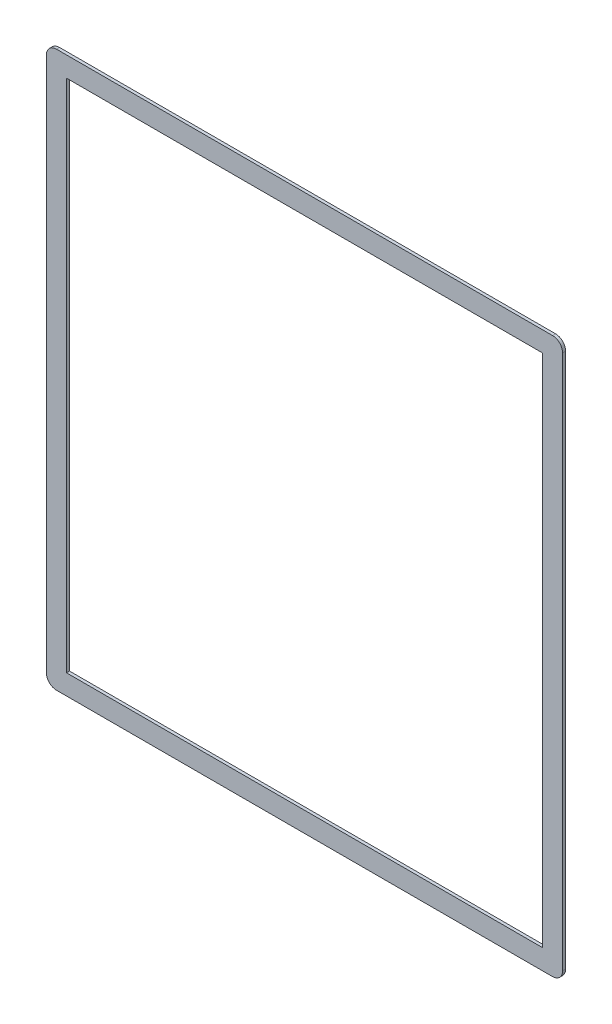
ISO-10303-21;
HEADER;
FILE_DESCRIPTION(('STEP AP214'),'2;1');
FILE_NAME('part.step','',(''),(''),'','','');
FILE_SCHEMA(('AUTOMOTIVE_DESIGN { 1 0 10303 214 1 1 1 1 }'));
ENDSEC;
DATA;
#1=APPLICATION_CONTEXT('core data for automotive mechanical design processes');
#2=APPLICATION_PROTOCOL_DEFINITION('international standard','automotive_design',2000,#1);
#3=PRODUCT_CONTEXT('',#1,'mechanical');
#4=PRODUCT('Part','Part','',(#3));
#5=PRODUCT_RELATED_PRODUCT_CATEGORY('part','',(#4));
#6=PRODUCT_DEFINITION_FORMATION('','',#4);
#7=PRODUCT_DEFINITION_CONTEXT('part definition',#1,'design');
#8=PRODUCT_DEFINITION('design','',#6,#7);
#9=PRODUCT_DEFINITION_SHAPE('','',#8);
#10=(LENGTH_UNIT() NAMED_UNIT(*) SI_UNIT(.MILLI.,.METRE.));
#11=(NAMED_UNIT(*) PLANE_ANGLE_UNIT() SI_UNIT($,.RADIAN.));
#12=(NAMED_UNIT(*) SI_UNIT($,.STERADIAN.) SOLID_ANGLE_UNIT());
#13=UNCERTAINTY_MEASURE_WITH_UNIT(LENGTH_MEASURE(1.E-05),#10,'distance_accuracy_value','');
#14=(GEOMETRIC_REPRESENTATION_CONTEXT(3) GLOBAL_UNCERTAINTY_ASSIGNED_CONTEXT((#13)) GLOBAL_UNIT_ASSIGNED_CONTEXT((#10,
#11,#12)) REPRESENTATION_CONTEXT('',''));
#15=CARTESIAN_POINT('',(0.,0.,0.));
#16=DIRECTION('',(0.,0.,1.));
#17=DIRECTION('',(1.,0.,0.));
#18=AXIS2_PLACEMENT_3D('',#15,#16,#17);
#19=CARTESIAN_POINT('',(-163.57003865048,163.574091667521,1.905));
#20=DIRECTION('',(0.,0.,-1.));
#21=DIRECTION('',(-1.,0.,0.));
#22=AXIS2_PLACEMENT_3D('',#19,#20,#21);
#23=CYLINDRICAL_SURFACE('',#22,6.34999999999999);
#24=CARTESIAN_POINT('',(-163.57003865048,163.574091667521,0.));
#25=DIRECTION('',(0.,0.,1.));
#26=DIRECTION('',(1.,0.,0.));
#27=AXIS2_PLACEMENT_3D('',#24,#25,#26);
#28=CIRCLE('',#27,6.34999999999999);
#29=CARTESIAN_POINT('',(-163.57003865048,169.92409166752,0.));
#30=VERTEX_POINT('',#29);
#31=CARTESIAN_POINT('',(-169.92003865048,163.574091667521,0.));
#32=VERTEX_POINT('',#31);
#33=EDGE_CURVE('E127',#30,#32,#28,.T.);
#34=ORIENTED_EDGE('',*,*,#33,.T.);
#35=DIRECTION('',(0.,0.,-1.));
#36=VECTOR('',#35,1.);
#37=CARTESIAN_POINT('',(-169.92003865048,163.574091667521,1.905));
#38=LINE('',#37,#36);
#39=CARTESIAN_POINT('',(-169.92003865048,163.574091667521,1.905));
#40=VERTEX_POINT('',#39);
#41=EDGE_CURVE('E11',#40,#32,#38,.T.);
#42=ORIENTED_EDGE('',*,*,#41,.F.);
#43=CARTESIAN_POINT('',(-163.57003865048,163.574091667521,1.905));
#44=DIRECTION('',(0.,0.,1.));
#45=DIRECTION('',(1.,0.,0.));
#46=AXIS2_PLACEMENT_3D('',#43,#44,#45);
#47=CIRCLE('',#46,6.34999999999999);
#48=CARTESIAN_POINT('',(-163.57003865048,169.92409166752,1.905));
#49=VERTEX_POINT('',#48);
#50=EDGE_CURVE('E156',#49,#40,#47,.T.);
#51=ORIENTED_EDGE('',*,*,#50,.F.);
#52=DIRECTION('',(0.,0.,-1.));
#53=VECTOR('',#52,1.);
#54=CARTESIAN_POINT('',(-163.57003865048,169.92409166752,1.905));
#55=LINE('',#54,#53);
#56=EDGE_CURVE('E174',#49,#30,#55,.T.);
#57=ORIENTED_EDGE('',*,*,#56,.T.);
#58=EDGE_LOOP('',(#34,#42,#51,#57));
#59=FACE_BOUND('',#58,.T.);
#60=ADVANCED_FACE('F32',(#59),#23,.T.);
#61=CARTESIAN_POINT('',(-169.92003865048,163.574091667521,1.905));
#62=DIRECTION('',(1.,0.,0.));
#63=DIRECTION('',(0.,1.,0.));
#64=AXIS2_PLACEMENT_3D('',#61,#62,#63);
#65=PLANE('',#64);
#66=DIRECTION('',(0.,-1.,0.));
#67=VECTOR('',#66,1.);
#68=CARTESIAN_POINT('',(-169.92003865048,163.574091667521,0.));
#69=LINE('',#68,#67);
#70=CARTESIAN_POINT('',(-169.92003865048,-174.499908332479,0.));
#71=VERTEX_POINT('',#70);
#72=EDGE_CURVE('E177',#32,#71,#69,.T.);
#73=ORIENTED_EDGE('',*,*,#72,.T.);
#74=DIRECTION('',(0.,0.,-1.));
#75=VECTOR('',#74,1.);
#76=CARTESIAN_POINT('',(-169.92003865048,-174.499908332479,1.905));
#77=LINE('',#76,#75);
#78=CARTESIAN_POINT('',(-169.92003865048,-174.499908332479,1.905));
#79=VERTEX_POINT('',#78);
#80=EDGE_CURVE('E39',#79,#71,#77,.T.);
#81=ORIENTED_EDGE('',*,*,#80,.F.);
#82=DIRECTION('',(0.,-1.,0.));
#83=VECTOR('',#82,1.);
#84=CARTESIAN_POINT('',(-169.92003865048,163.574091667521,1.905));
#85=LINE('',#84,#83);
#86=EDGE_CURVE('E159',#40,#79,#85,.T.);
#87=ORIENTED_EDGE('',*,*,#86,.F.);
#88=ORIENTED_EDGE('',*,*,#41,.T.);
#89=EDGE_LOOP('',(#73,#81,#87,#88));
#90=FACE_BOUND('',#89,.T.);
#91=ADVANCED_FACE('F232',(#90),#65,.F.);
#92=CARTESIAN_POINT('',(-163.57003865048,-174.499908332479,1.905));
#93=DIRECTION('',(0.,0.,-1.));
#94=DIRECTION('',(-1.,0.,0.));
#95=AXIS2_PLACEMENT_3D('',#92,#93,#94);
#96=CYLINDRICAL_SURFACE('',#95,6.34999999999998);
#97=CARTESIAN_POINT('',(-163.57003865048,-174.499908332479,0.));
#98=DIRECTION('',(0.,0.,1.));
#99=DIRECTION('',(1.,0.,0.));
#100=AXIS2_PLACEMENT_3D('',#97,#98,#99);
#101=CIRCLE('',#100,6.34999999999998);
#102=CARTESIAN_POINT('',(-163.57003865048,-180.849908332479,0.));
#103=VERTEX_POINT('',#102);
#104=EDGE_CURVE('E179',#71,#103,#101,.T.);
#105=ORIENTED_EDGE('',*,*,#104,.T.);
#106=DIRECTION('',(0.,0.,-1.));
#107=VECTOR('',#106,1.);
#108=CARTESIAN_POINT('',(-163.57003865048,-180.849908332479,1.905));
#109=LINE('',#108,#107);
#110=CARTESIAN_POINT('',(-163.57003865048,-180.849908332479,1.905));
#111=VERTEX_POINT('',#110);
#112=EDGE_CURVE('E204',#111,#103,#109,.T.);
#113=ORIENTED_EDGE('',*,*,#112,.F.);
#114=CARTESIAN_POINT('',(-163.57003865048,-174.499908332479,1.905));
#115=DIRECTION('',(0.,0.,1.));
#116=DIRECTION('',(1.,0.,0.));
#117=AXIS2_PLACEMENT_3D('',#114,#115,#116);
#118=CIRCLE('',#117,6.34999999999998);
#119=EDGE_CURVE('E162',#79,#111,#118,.T.);
#120=ORIENTED_EDGE('',*,*,#119,.F.);
#121=ORIENTED_EDGE('',*,*,#80,.T.);
#122=EDGE_LOOP('',(#105,#113,#120,#121));
#123=FACE_BOUND('',#122,.T.);
#124=ADVANCED_FACE('F211',(#123),#96,.T.);
#125=CARTESIAN_POINT('',(-163.57003865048,-180.849908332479,1.905));
#126=DIRECTION('',(0.,1.,0.));
#127=DIRECTION('',(-1.,0.,0.));
#128=AXIS2_PLACEMENT_3D('',#125,#126,#127);
#129=PLANE('',#128);
#130=DIRECTION('',(1.,0.,0.));
#131=VECTOR('',#130,1.);
#132=CARTESIAN_POINT('',(-163.57003865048,-180.849908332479,0.));
#133=LINE('',#132,#131);
#134=CARTESIAN_POINT('',(149.86596134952,-180.849908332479,0.));
#135=VERTEX_POINT('',#134);
#136=EDGE_CURVE('E181',#103,#135,#133,.T.);
#137=ORIENTED_EDGE('',*,*,#136,.T.);
#138=DIRECTION('',(0.,0.,-1.));
#139=VECTOR('',#138,1.);
#140=CARTESIAN_POINT('',(149.86596134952,-180.849908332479,1.905));
#141=LINE('',#140,#139);
#142=CARTESIAN_POINT('',(149.86596134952,-180.849908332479,1.905));
#143=VERTEX_POINT('',#142);
#144=EDGE_CURVE('E201',#143,#135,#141,.T.);
#145=ORIENTED_EDGE('',*,*,#144,.F.);
#146=DIRECTION('',(1.,0.,0.));
#147=VECTOR('',#146,1.);
#148=CARTESIAN_POINT('',(-163.57003865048,-180.849908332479,1.905));
#149=LINE('',#148,#147);
#150=EDGE_CURVE('E164',#111,#143,#149,.T.);
#151=ORIENTED_EDGE('',*,*,#150,.F.);
#152=ORIENTED_EDGE('',*,*,#112,.T.);
#153=EDGE_LOOP('',(#137,#145,#151,#152));
#154=FACE_BOUND('',#153,.T.);
#155=ADVANCED_FACE('F220',(#154),#129,.F.);
#156=CARTESIAN_POINT('',(149.86596134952,-174.499908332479,1.905));
#157=DIRECTION('',(0.,0.,-1.));
#158=DIRECTION('',(-1.,0.,0.));
#159=AXIS2_PLACEMENT_3D('',#156,#157,#158);
#160=CYLINDRICAL_SURFACE('',#159,6.34999999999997);
#161=CARTESIAN_POINT('',(149.86596134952,-174.499908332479,0.));
#162=DIRECTION('',(0.,0.,1.));
#163=DIRECTION('',(1.,0.,0.));
#164=AXIS2_PLACEMENT_3D('',#161,#162,#163);
#165=CIRCLE('',#164,6.34999999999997);
#166=CARTESIAN_POINT('',(156.21596134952,-174.499908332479,0.));
#167=VERTEX_POINT('',#166);
#168=EDGE_CURVE('E183',#135,#167,#165,.T.);
#169=ORIENTED_EDGE('',*,*,#168,.T.);
#170=DIRECTION('',(0.,0.,-1.));
#171=VECTOR('',#170,1.);
#172=CARTESIAN_POINT('',(156.21596134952,-174.499908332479,1.905));
#173=LINE('',#172,#171);
#174=CARTESIAN_POINT('',(156.21596134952,-174.499908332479,1.905));
#175=VERTEX_POINT('',#174);
#176=EDGE_CURVE('E198',#175,#167,#173,.T.);
#177=ORIENTED_EDGE('',*,*,#176,.F.);
#178=CARTESIAN_POINT('',(149.86596134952,-174.499908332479,1.905));
#179=DIRECTION('',(0.,0.,1.));
#180=DIRECTION('',(1.,0.,0.));
#181=AXIS2_PLACEMENT_3D('',#178,#179,#180);
#182=CIRCLE('',#181,6.34999999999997);
#183=EDGE_CURVE('E166',#143,#175,#182,.T.);
#184=ORIENTED_EDGE('',*,*,#183,.F.);
#185=ORIENTED_EDGE('',*,*,#144,.T.);
#186=EDGE_LOOP('',(#169,#177,#184,#185));
#187=FACE_BOUND('',#186,.T.);
#188=ADVANCED_FACE('F224',(#187),#160,.T.);
#189=CARTESIAN_POINT('',(156.21596134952,-174.499908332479,1.905));
#190=DIRECTION('',(-1.,0.,0.));
#191=DIRECTION('',(0.,-1.,0.));
#192=AXIS2_PLACEMENT_3D('',#189,#190,#191);
#193=PLANE('',#192);
#194=DIRECTION('',(0.,1.,0.));
#195=VECTOR('',#194,1.);
#196=CARTESIAN_POINT('',(156.21596134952,-174.499908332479,0.));
#197=LINE('',#196,#195);
#198=CARTESIAN_POINT('',(156.21596134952,163.574091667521,0.));
#199=VERTEX_POINT('',#198);
#200=EDGE_CURVE('E185',#167,#199,#197,.T.);
#201=ORIENTED_EDGE('',*,*,#200,.T.);
#202=DIRECTION('',(0.,0.,-1.));
#203=VECTOR('',#202,1.);
#204=CARTESIAN_POINT('',(156.21596134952,163.574091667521,1.905));
#205=LINE('',#204,#203);
#206=CARTESIAN_POINT('',(156.21596134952,163.574091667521,1.905));
#207=VERTEX_POINT('',#206);
#208=EDGE_CURVE('E195',#207,#199,#205,.T.);
#209=ORIENTED_EDGE('',*,*,#208,.F.);
#210=DIRECTION('',(0.,1.,0.));
#211=VECTOR('',#210,1.);
#212=CARTESIAN_POINT('',(156.21596134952,-174.499908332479,1.905));
#213=LINE('',#212,#211);
#214=EDGE_CURVE('E168',#175,#207,#213,.T.);
#215=ORIENTED_EDGE('',*,*,#214,.F.);
#216=ORIENTED_EDGE('',*,*,#176,.T.);
#217=EDGE_LOOP('',(#201,#209,#215,#216));
#218=FACE_BOUND('',#217,.T.);
#219=ADVANCED_FACE('F245',(#218),#193,.F.);
#220=CARTESIAN_POINT('',(149.86596134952,163.574091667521,1.905));
#221=DIRECTION('',(0.,0.,-1.));
#222=DIRECTION('',(-1.,0.,0.));
#223=AXIS2_PLACEMENT_3D('',#220,#221,#222);
#224=CYLINDRICAL_SURFACE('',#223,6.34999999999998);
#225=CARTESIAN_POINT('',(149.86596134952,163.574091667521,0.));
#226=DIRECTION('',(0.,0.,1.));
#227=DIRECTION('',(1.,0.,0.));
#228=AXIS2_PLACEMENT_3D('',#225,#226,#227);
#229=CIRCLE('',#228,6.34999999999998);
#230=CARTESIAN_POINT('',(149.86596134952,169.924091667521,0.));
#231=VERTEX_POINT('',#230);
#232=EDGE_CURVE('E187',#199,#231,#229,.T.);
#233=ORIENTED_EDGE('',*,*,#232,.T.);
#234=DIRECTION('',(0.,0.,-1.));
#235=VECTOR('',#234,1.);
#236=CARTESIAN_POINT('',(149.86596134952,169.924091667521,1.905));
#237=LINE('',#236,#235);
#238=CARTESIAN_POINT('',(149.86596134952,169.924091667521,1.905));
#239=VERTEX_POINT('',#238);
#240=EDGE_CURVE('E192',#239,#231,#237,.T.);
#241=ORIENTED_EDGE('',*,*,#240,.F.);
#242=CARTESIAN_POINT('',(149.86596134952,163.574091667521,1.905));
#243=DIRECTION('',(0.,0.,1.));
#244=DIRECTION('',(1.,0.,0.));
#245=AXIS2_PLACEMENT_3D('',#242,#243,#244);
#246=CIRCLE('',#245,6.34999999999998);
#247=EDGE_CURVE('E170',#207,#239,#246,.T.);
#248=ORIENTED_EDGE('',*,*,#247,.F.);
#249=ORIENTED_EDGE('',*,*,#208,.T.);
#250=EDGE_LOOP('',(#233,#241,#248,#249));
#251=FACE_BOUND('',#250,.T.);
#252=ADVANCED_FACE('F243',(#251),#224,.T.);
#253=CARTESIAN_POINT('',(149.86596134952,169.924091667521,1.905));
#254=DIRECTION('',(0.,-1.,0.));
#255=DIRECTION('',(1.,0.,0.));
#256=AXIS2_PLACEMENT_3D('',#253,#254,#255);
#257=PLANE('',#256);
#258=DIRECTION('',(-1.,0.,0.));
#259=VECTOR('',#258,1.);
#260=CARTESIAN_POINT('',(149.86596134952,169.924091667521,0.));
#261=LINE('',#260,#259);
#262=EDGE_CURVE('E160',#231,#30,#261,.T.);
#263=ORIENTED_EDGE('',*,*,#262,.T.);
#264=ORIENTED_EDGE('',*,*,#56,.F.);
#265=DIRECTION('',(-1.,0.,0.));
#266=VECTOR('',#265,1.);
#267=CARTESIAN_POINT('',(149.86596134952,169.924091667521,1.905));
#268=LINE('',#267,#266);
#269=EDGE_CURVE('E172',#239,#49,#268,.T.);
#270=ORIENTED_EDGE('',*,*,#269,.F.);
#271=ORIENTED_EDGE('',*,*,#240,.T.);
#272=EDGE_LOOP('',(#263,#264,#270,#271));
#273=FACE_BOUND('',#272,.T.);
#274=ADVANCED_FACE('F238',(#273),#257,.F.);
#275=CARTESIAN_POINT('',(-163.57003865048,163.574091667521,1.905));
#276=DIRECTION('',(0.,0.,1.));
#277=DIRECTION('',(1.,0.,0.));
#278=AXIS2_PLACEMENT_3D('',#275,#276,#277);
#279=PLANE('',#278);
#280=DIRECTION('',(-1.,0.,0.));
#281=VECTOR('',#280,1.);
#282=CARTESIAN_POINT('',(149.86596134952,157.224091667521,1.905));
#283=LINE('',#282,#281);
#284=CARTESIAN_POINT('',(143.51596134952,157.224091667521,1.905));
#285=VERTEX_POINT('',#284);
#286=CARTESIAN_POINT('',(-157.22003865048,157.22409166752,1.905));
#287=VERTEX_POINT('',#286);
#288=EDGE_CURVE('E124',#285,#287,#283,.T.);
#289=ORIENTED_EDGE('',*,*,#288,.F.);
#290=DIRECTION('',(0.,1.,0.));
#291=VECTOR('',#290,1.);
#292=CARTESIAN_POINT('',(143.51596134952,-174.499908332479,1.905));
#293=LINE('',#292,#291);
#294=CARTESIAN_POINT('',(143.51596134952,-168.149908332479,1.905));
#295=VERTEX_POINT('',#294);
#296=EDGE_CURVE('E152',#295,#285,#293,.T.);
#297=ORIENTED_EDGE('',*,*,#296,.F.);
#298=DIRECTION('',(1.,0.,0.));
#299=VECTOR('',#298,1.);
#300=CARTESIAN_POINT('',(-163.57003865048,-168.149908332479,1.905));
#301=LINE('',#300,#299);
#302=CARTESIAN_POINT('',(-157.22003865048,-168.149908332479,1.905));
#303=VERTEX_POINT('',#302);
#304=EDGE_CURVE('E145',#303,#295,#301,.T.);
#305=ORIENTED_EDGE('',*,*,#304,.F.);
#306=DIRECTION('',(0.,-1.,0.));
#307=VECTOR('',#306,1.);
#308=CARTESIAN_POINT('',(-157.22003865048,163.574091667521,1.905));
#309=LINE('',#308,#307);
#310=EDGE_CURVE('E143',#287,#303,#309,.T.);
#311=ORIENTED_EDGE('',*,*,#310,.F.);
#312=EDGE_LOOP('',(#289,#297,#305,#311));
#313=FACE_BOUND('',#312,.T.);
#314=ORIENTED_EDGE('',*,*,#50,.T.);
#315=ORIENTED_EDGE('',*,*,#86,.T.);
#316=ORIENTED_EDGE('',*,*,#119,.T.);
#317=ORIENTED_EDGE('',*,*,#150,.T.);
#318=ORIENTED_EDGE('',*,*,#183,.T.);
#319=ORIENTED_EDGE('',*,*,#214,.T.);
#320=ORIENTED_EDGE('',*,*,#247,.T.);
#321=ORIENTED_EDGE('',*,*,#269,.T.);
#322=EDGE_LOOP('',(#314,#315,#316,#317,#318,#319,#320,#321));
#323=FACE_BOUND('',#322,.T.);
#324=ADVANCED_FACE('F228',(#313,#323),#279,.T.);
#325=CARTESIAN_POINT('',(-163.57003865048,163.574091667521,0.));
#326=DIRECTION('',(0.,0.,1.));
#327=DIRECTION('',(1.,0.,0.));
#328=AXIS2_PLACEMENT_3D('',#325,#326,#327);
#329=PLANE('',#328);
#330=DIRECTION('',(-1.,0.,0.));
#331=VECTOR('',#330,1.);
#332=CARTESIAN_POINT('',(149.86596134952,157.224091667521,0.));
#333=LINE('',#332,#331);
#334=CARTESIAN_POINT('',(143.51596134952,157.224091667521,0.));
#335=VERTEX_POINT('',#334);
#336=CARTESIAN_POINT('',(-157.22003865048,157.22409166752,0.));
#337=VERTEX_POINT('',#336);
#338=EDGE_CURVE('E121',#335,#337,#333,.T.);
#339=ORIENTED_EDGE('',*,*,#338,.T.);
#340=DIRECTION('',(0.,-1.,0.));
#341=VECTOR('',#340,1.);
#342=CARTESIAN_POINT('',(-157.22003865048,163.574091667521,0.));
#343=LINE('',#342,#341);
#344=CARTESIAN_POINT('',(-157.22003865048,-168.149908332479,0.));
#345=VERTEX_POINT('',#344);
#346=EDGE_CURVE('E132',#337,#345,#343,.T.);
#347=ORIENTED_EDGE('',*,*,#346,.T.);
#348=DIRECTION('',(1.,0.,0.));
#349=VECTOR('',#348,1.);
#350=CARTESIAN_POINT('',(-163.57003865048,-168.149908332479,0.));
#351=LINE('',#350,#349);
#352=CARTESIAN_POINT('',(143.51596134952,-168.149908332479,0.));
#353=VERTEX_POINT('',#352);
#354=EDGE_CURVE('E137',#345,#353,#351,.T.);
#355=ORIENTED_EDGE('',*,*,#354,.T.);
#356=DIRECTION('',(0.,1.,0.));
#357=VECTOR('',#356,1.);
#358=CARTESIAN_POINT('',(143.51596134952,-174.499908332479,0.));
#359=LINE('',#358,#357);
#360=EDGE_CURVE('E142',#353,#335,#359,.T.);
#361=ORIENTED_EDGE('',*,*,#360,.T.);
#362=EDGE_LOOP('',(#339,#347,#355,#361));
#363=FACE_BOUND('',#362,.T.);
#364=ORIENTED_EDGE('',*,*,#33,.F.);
#365=ORIENTED_EDGE('',*,*,#262,.F.);
#366=ORIENTED_EDGE('',*,*,#232,.F.);
#367=ORIENTED_EDGE('',*,*,#200,.F.);
#368=ORIENTED_EDGE('',*,*,#168,.F.);
#369=ORIENTED_EDGE('',*,*,#136,.F.);
#370=ORIENTED_EDGE('',*,*,#104,.F.);
#371=ORIENTED_EDGE('',*,*,#72,.F.);
#372=EDGE_LOOP('',(#364,#365,#366,#367,#368,#369,#370,#371));
#373=FACE_BOUND('',#372,.T.);
#374=ADVANCED_FACE('F140',(#363,#373),#329,.F.);
#375=CARTESIAN_POINT('',(-157.22003865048,163.574091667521,1.905));
#376=DIRECTION('',(1.,0.,0.));
#377=DIRECTION('',(0.,1.,0.));
#378=AXIS2_PLACEMENT_3D('',#375,#376,#377);
#379=PLANE('',#378);
#380=ORIENTED_EDGE('',*,*,#346,.F.);
#381=DIRECTION('',(0.,0.,-1.));
#382=VECTOR('',#381,1.);
#383=CARTESIAN_POINT('',(-157.22003865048,157.22409166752,1.905));
#384=LINE('',#383,#382);
#385=EDGE_CURVE('E116',#287,#337,#384,.T.);
#386=ORIENTED_EDGE('',*,*,#385,.F.);
#387=ORIENTED_EDGE('',*,*,#310,.T.);
#388=DIRECTION('',(0.,0.,-1.));
#389=VECTOR('',#388,1.);
#390=CARTESIAN_POINT('',(-157.22003865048,-168.149908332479,1.905));
#391=LINE('',#390,#389);
#392=EDGE_CURVE('E128',#303,#345,#391,.T.);
#393=ORIENTED_EDGE('',*,*,#392,.T.);
#394=EDGE_LOOP('',(#380,#386,#387,#393));
#395=FACE_BOUND('',#394,.T.);
#396=ADVANCED_FACE('F133',(#395),#379,.T.);
#397=CARTESIAN_POINT('',(-163.57003865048,-168.149908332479,1.905));
#398=DIRECTION('',(0.,1.,0.));
#399=DIRECTION('',(-1.,0.,0.));
#400=AXIS2_PLACEMENT_3D('',#397,#398,#399);
#401=PLANE('',#400);
#402=ORIENTED_EDGE('',*,*,#354,.F.);
#403=ORIENTED_EDGE('',*,*,#392,.F.);
#404=ORIENTED_EDGE('',*,*,#304,.T.);
#405=DIRECTION('',(0.,0.,-1.));
#406=VECTOR('',#405,1.);
#407=CARTESIAN_POINT('',(143.51596134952,-168.149908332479,1.905));
#408=LINE('',#407,#406);
#409=EDGE_CURVE('E46',#295,#353,#408,.T.);
#410=ORIENTED_EDGE('',*,*,#409,.T.);
#411=EDGE_LOOP('',(#402,#403,#404,#410));
#412=FACE_BOUND('',#411,.T.);
#413=ADVANCED_FACE('F316',(#412),#401,.T.);
#414=CARTESIAN_POINT('',(143.51596134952,-174.499908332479,1.905));
#415=DIRECTION('',(-1.,0.,0.));
#416=DIRECTION('',(0.,-1.,0.));
#417=AXIS2_PLACEMENT_3D('',#414,#415,#416);
#418=PLANE('',#417);
#419=ORIENTED_EDGE('',*,*,#360,.F.);
#420=ORIENTED_EDGE('',*,*,#409,.F.);
#421=ORIENTED_EDGE('',*,*,#296,.T.);
#422=DIRECTION('',(0.,0.,-1.));
#423=VECTOR('',#422,1.);
#424=CARTESIAN_POINT('',(143.51596134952,157.224091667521,1.905));
#425=LINE('',#424,#423);
#426=EDGE_CURVE('E155',#285,#335,#425,.T.);
#427=ORIENTED_EDGE('',*,*,#426,.T.);
#428=EDGE_LOOP('',(#419,#420,#421,#427));
#429=FACE_BOUND('',#428,.T.);
#430=ADVANCED_FACE('F325',(#429),#418,.T.);
#431=CARTESIAN_POINT('',(149.86596134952,157.224091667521,1.905));
#432=DIRECTION('',(0.,-1.,0.));
#433=DIRECTION('',(1.,0.,0.));
#434=AXIS2_PLACEMENT_3D('',#431,#432,#433);
#435=PLANE('',#434);
#436=ORIENTED_EDGE('',*,*,#338,.F.);
#437=ORIENTED_EDGE('',*,*,#426,.F.);
#438=ORIENTED_EDGE('',*,*,#288,.T.);
#439=ORIENTED_EDGE('',*,*,#385,.T.);
#440=EDGE_LOOP('',(#436,#437,#438,#439));
#441=FACE_BOUND('',#440,.T.);
#442=ADVANCED_FACE('F118',(#441),#435,.T.);
#443=CLOSED_SHELL('',(#60,#91,#124,#155,#188,#219,#252,#274,#324,#374,#396,#413,#430,#442));
#444=MANIFOLD_SOLID_BREP('B2',#443);
#445=ADVANCED_BREP_SHAPE_REPRESENTATION('',(#18,#444),#14);
#446=SHAPE_DEFINITION_REPRESENTATION(#9,#445);
ENDSEC;
END-ISO-10303-21;
